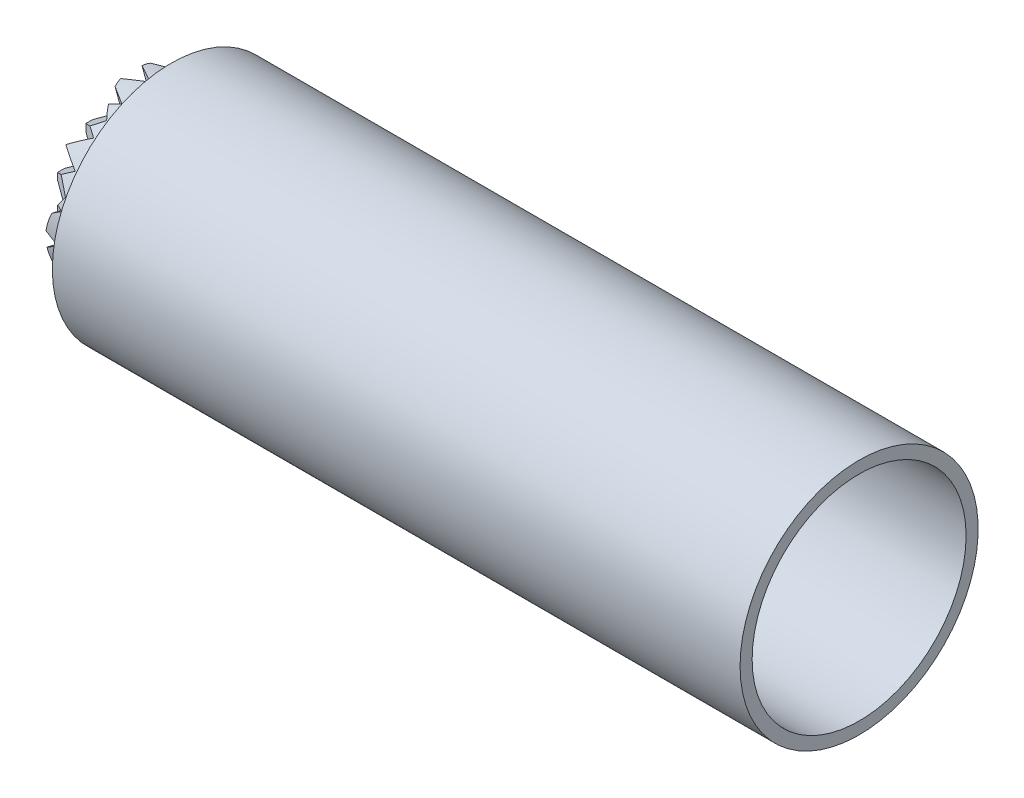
from build123d import *

# Parameters (mm, degrees)
CUT_EXTRUDE1_DEPTH      = 10
CUT_EXTRUDE1_DEPTH_BACK = 10
CUT_EXTRUDE2_DEPTH      = 10
CUT_EXTRUDE2_DEPTH_BACK = 10
CUT_EXTRUDE3_REACH      = 39.656
CUT_EXTRUDE3_END_RADIUS = 6.331
BOSS_EXTRUDE1_DEPTH     = 0.64


with BuildPart() as part:
    # Sketch1 → Revolve1 (revolve)
    with BuildSketch(Plane.XY, mode=Mode.PRIVATE) as revolve1_sk:
        Polygon((0, 0), (-2.032, 0), (-2.032, 4.978), (0, 4.978), (0, 6.331), (36.576, 6.331), (36.576, 5.6896), (1.524523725, 5.6896), align=None)
    revolve(revolve1_sk.sketch.rotate(Axis((0, 0, 0), (1, 0, 0)), 90), axis=Axis((0, 0, 0), (1, 0, 0)))

    # Sketch2 → Cut-Extrude1 (cut, two sides: drawn at the far end of the back side and taken through both)
    with BuildSketch(Plane(origin=(0, 0, 0), x_dir=(1, 0, 0), z_dir=(0, 1, 0)).offset(-CUT_EXTRUDE1_DEPTH_BACK)):
        Polygon((-2.032, 4.978), (-1.041, 4.405845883), (-2.032, 3.833691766), align=None)
        Polygon((-1.041, 2.905845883), (-2.032, 2.333691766), (-2.032, 3.478), align=None)
        Polygon((-1.041, 1.405845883), (-2.032, 0.833691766), (-2.032, 1.978), align=None)
        Polygon((-1.041, -0.094154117), (-2.032, -0.666308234), (-2.032, 0.478), align=None)
        Polygon((-1.041, -1.594154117), (-2.032, -2.166308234), (-2.032, -1.022), align=None)
        Polygon((-1.041, -3.094154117), (-2.032, -3.666308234), (-2.032, -2.522), align=None)
        Polygon((-1.041, -4.594154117), (-2.032, -5.166308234), (-2.032, -4.022), align=None)
    extrude(amount=CUT_EXTRUDE1_DEPTH + CUT_EXTRUDE1_DEPTH_BACK, mode=Mode.SUBTRACT)

    # Sketch5 → Cut-Extrude2 (cut, two sides: drawn at the far end of the back side and taken through both)
    with BuildSketch(Plane.XY.offset(-CUT_EXTRUDE2_DEPTH_BACK)):
        Polygon((-2.032, 4.933205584), (-1.041, 4.361051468), (-2.032, 3.788897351), align=None)
        Polygon((-1.041, 2.861051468), (-2.032, 2.288897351), (-2.032, 3.433205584), align=None)
        Polygon((-1.041, 1.361051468), (-2.032, 0.788897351), (-2.032, 1.933205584), align=None)
        Polygon((-1.041, -0.138948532), (-2.032, -0.711102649), (-2.032, 0.433205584), align=None)
        Polygon((-1.041, -1.638948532), (-2.032, -2.211102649), (-2.032, -1.066794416), align=None)
        Polygon((-1.041, -3.138948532), (-2.032, -3.711102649), (-2.032, -2.566794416), align=None)
        Polygon((-1.041, -4.638948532), (-2.032, -5.211102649), (-2.032, -4.066794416), align=None)
    extrude(amount=CUT_EXTRUDE2_DEPTH + CUT_EXTRUDE2_DEPTH_BACK, mode=Mode.SUBTRACT)

    # Cut-Extrude3: up to this cylinder (the profile starts inside it)
    cut_extrude3_end = Plane(origin=(3.756432, 0, 0), z_dir=(-1, 0, 0)) * Cylinder(CUT_EXTRUDE3_END_RADIUS, 92.974, mode=Mode.PRIVATE)
    # Sketch6 → Cut-Extrude3 (cut, up to the surface)
    with BuildSketch(Plane(origin=(0, 0, 0), x_dir=(1, 0, 0), z_dir=(0, 1, 0)), mode=Mode.PRIVATE) as cut_extrude3_sk1:
        with BuildLine():
            Line((5.271023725, 0.898025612), (5.271023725, -0.898025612))
            ThreePointArc((5.271023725, -0.898025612), (2.096023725, 0), (5.271023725, 0.898025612))
        make_face()
    cut_extrude3_tool1 = extrude(cut_extrude3_sk1.sketch, amount=-CUT_EXTRUDE3_REACH, mode=Mode.PRIVATE) & cut_extrude3_end
    add(cut_extrude3_tool1.solids().sort_by_distance((3.756432, 0, 0))[0], mode=Mode.SUBTRACT)


with BuildPart() as body_2:
    # Sketch9 → Boss-Extrude1 (new body)
    with BuildSketch(Plane(origin=(1.520480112, 0.877849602, 0), x_dir=(0, 0, -1), z_dir=(0.8660254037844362, 0.5000000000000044, 0))):
        with BuildLine():
            Line((-0.898025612, -7.501087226), (0.898025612, -7.501087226))
            add(Edge.make_bspline(
                [(0.898025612, -7.501087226), (1.056646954, -7.430363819), (1.195048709, -7.345473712), (1.432998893, -7.154602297), (1.527319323, -7.052563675), (1.663436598, -6.84520825), (1.702974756, -6.742883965), (1.721701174, -6.551498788), (1.700495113, -6.464060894), (1.599385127, -6.311618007), (1.520175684, -6.247345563), (1.311832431, -6.141115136), (1.183982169, -6.099629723), (0.890287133, -6.035227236), (0.725426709, -6.012534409), (0.462354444, -5.990108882), (0.370741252, -5.984515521), (0.18755326, -5.977193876), (0.0953093, -5.975381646), (-0.090485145, -5.975319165), (-0.184827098, -5.977120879), (-0.368339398, -5.984384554), (-0.458084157, -5.989815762), (-0.721406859, -6.012054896), (-0.887408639, -6.034778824), (-1.327696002, -6.1307837), (-1.547466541, -6.235021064), (-1.699429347, -6.46162833), (-1.721380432, -6.549921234), (-1.703731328, -6.739891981), (-1.66395873, -6.84384656), (-1.529505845, -7.049787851), (-1.433496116, -7.153925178), (-1.19825118, -7.343178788), (-1.056664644, -7.430355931), (-0.898025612, -7.501087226)],
                knots=[0, 0, 0, 0, 0.0625, 0.0625, 0.125, 0.125, 0.1875, 0.1875, 0.25, 0.25, 0.3125, 0.3125, 0.375, 0.375, 0.4375, 0.4375, 0.46875, 0.46875, 0.5, 0.5, 0.53125, 0.53125, 0.5625, 0.5625, 0.625, 0.625, 0.75, 0.75, 0.8125, 0.8125, 0.875, 0.875, 0.9375, 0.9375, 1, 1, 1, 1], degree=3))
        make_face()
    extrude(amount=-BOSS_EXTRUDE1_DEPTH)


solid = Compound([part.part, body_2.part])
